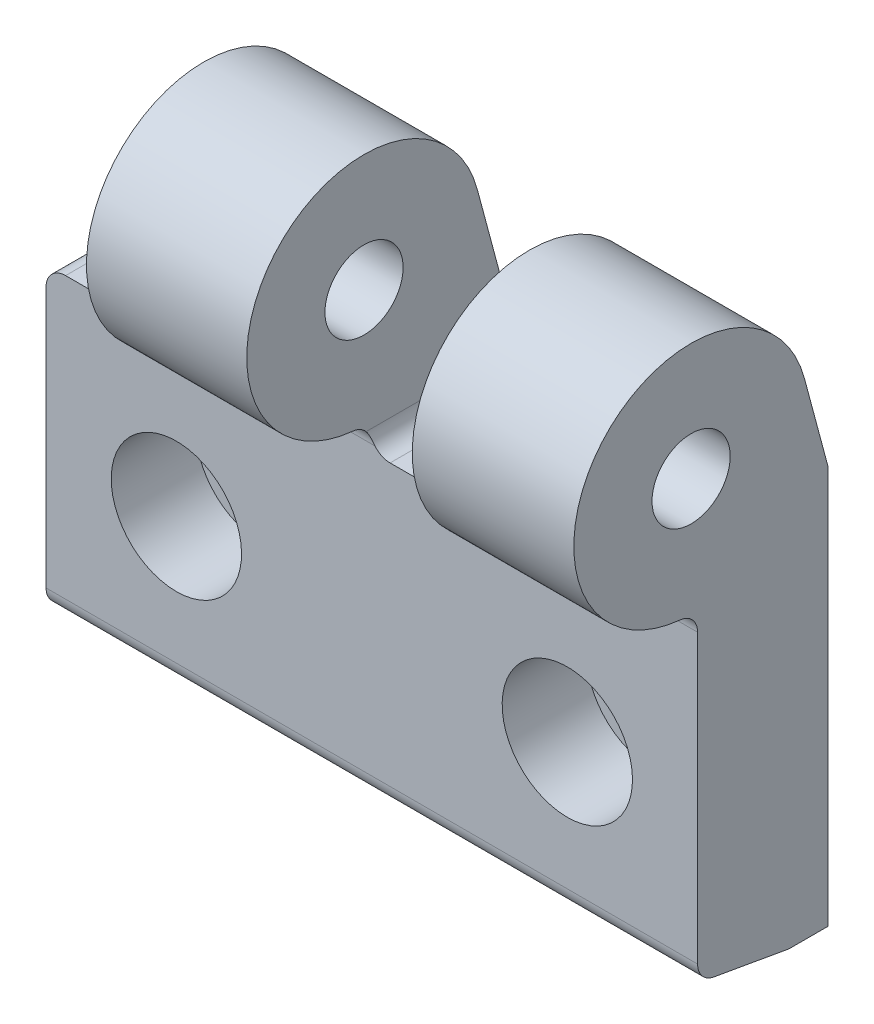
ISO-10303-21;
HEADER;
FILE_DESCRIPTION(('STEP AP214'),'2;1');
FILE_NAME('part.step','',(''),(''),'','','');
FILE_SCHEMA(('AUTOMOTIVE_DESIGN { 1 0 10303 214 1 1 1 1 }'));
ENDSEC;
DATA;
#1=APPLICATION_CONTEXT('core data for automotive mechanical design processes');
#2=APPLICATION_PROTOCOL_DEFINITION('international standard','automotive_design',2000,#1);
#3=PRODUCT_CONTEXT('',#1,'mechanical');
#4=PRODUCT('Part','Part','',(#3));
#5=PRODUCT_RELATED_PRODUCT_CATEGORY('part','',(#4));
#6=PRODUCT_DEFINITION_FORMATION('','',#4);
#7=PRODUCT_DEFINITION_CONTEXT('part definition',#1,'design');
#8=PRODUCT_DEFINITION('design','',#6,#7);
#9=PRODUCT_DEFINITION_SHAPE('','',#8);
#10=(LENGTH_UNIT() NAMED_UNIT(*) SI_UNIT(.MILLI.,.METRE.));
#11=(NAMED_UNIT(*) PLANE_ANGLE_UNIT() SI_UNIT($,.RADIAN.));
#12=(NAMED_UNIT(*) SI_UNIT($,.STERADIAN.) SOLID_ANGLE_UNIT());
#13=UNCERTAINTY_MEASURE_WITH_UNIT(LENGTH_MEASURE(1.E-05),#10,'distance_accuracy_value','');
#14=(GEOMETRIC_REPRESENTATION_CONTEXT(3) GLOBAL_UNCERTAINTY_ASSIGNED_CONTEXT((#13)) GLOBAL_UNIT_ASSIGNED_CONTEXT((#10,
#11,#12)) REPRESENTATION_CONTEXT('',''));
#15=CARTESIAN_POINT('',(0.,0.,0.));
#16=DIRECTION('',(0.,0.,1.));
#17=DIRECTION('',(1.,0.,0.));
#18=AXIS2_PLACEMENT_3D('',#15,#16,#17);
#19=CARTESIAN_POINT('',(40.,22.750000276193,10.5000324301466));
#20=DIRECTION('',(1.,0.,0.));
#21=DIRECTION('',(0.,1.,0.));
#22=AXIS2_PLACEMENT_3D('',#19,#20,#21);
#23=PLANE('',#22);
#24=DIRECTION('',(0.,0.,-1.));
#25=VECTOR('',#24,1.);
#26=CARTESIAN_POINT('',(40.,-12.25,3.));
#27=LINE('',#26,#25);
#28=CARTESIAN_POINT('',(40.,-12.25,3.));
#29=VERTEX_POINT('',#28);
#30=CARTESIAN_POINT('',(40.,-12.25,0.));
#31=VERTEX_POINT('',#30);
#32=EDGE_CURVE('E243',#29,#31,#27,.T.);
#33=ORIENTED_EDGE('',*,*,#32,.T.);
#34=DIRECTION('',(0.,1.,0.));
#35=VECTOR('',#34,1.);
#36=CARTESIAN_POINT('',(40.,-12.25,0.));
#37=LINE('',#36,#35);
#38=CARTESIAN_POINT('',(40.,18.3364567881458,0.));
#39=VERTEX_POINT('',#38);
#40=EDGE_CURVE('E244',#31,#39,#37,.T.);
#41=ORIENTED_EDGE('',*,*,#40,.T.);
#42=DIRECTION('',(0.,0.965927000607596,0.258814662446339));
#43=VECTOR('',#42,1.);
#44=CARTESIAN_POINT('',(40.,18.3364567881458,0.));
#45=LINE('',#44,#43);
#46=CARTESIAN_POINT('',(40.,25.0793174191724,1.806711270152));
#47=VERTEX_POINT('',#46);
#48=EDGE_CURVE('E247',#39,#47,#45,.T.);
#49=ORIENTED_EDGE('',*,*,#48,.T.);
#50=CARTESIAN_POINT('',(40.,22.750000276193,10.5000324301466));
#51=DIRECTION('',(1.,0.,0.));
#52=DIRECTION('',(0.,-1.,0.));
#53=AXIS2_PLACEMENT_3D('',#50,#51,#52);
#54=CIRCLE('',#53,8.99997506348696);
#55=CARTESIAN_POINT('',(40.,13.7909299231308,11.3571260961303));
#56=VERTEX_POINT('',#55);
#57=EDGE_CURVE('E250',#47,#56,#54,.T.);
#58=ORIENTED_EDGE('',*,*,#57,.T.);
#59=CARTESIAN_POINT('',(40.,12.2978016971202,11.499942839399));
#60=DIRECTION('',(-1.,0.,0.));
#61=DIRECTION('',(0.,1.,0.));
#62=AXIS2_PLACEMENT_3D('',#59,#60,#61);
#63=CIRCLE('',#62,1.4999428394);
#64=CARTESIAN_POINT('',(40.,12.2978,10.));
#65=VERTEX_POINT('',#64);
#66=EDGE_CURVE('E253',#56,#65,#63,.T.);
#67=ORIENTED_EDGE('',*,*,#66,.T.);
#68=DIRECTION('',(0.,-1.,0.));
#69=VECTOR('',#68,1.);
#70=CARTESIAN_POINT('',(40.,12.2978,10.));
#71=LINE('',#70,#69);
#72=CARTESIAN_POINT('',(40.,-9.7568,10.));
#73=VERTEX_POINT('',#72);
#74=EDGE_CURVE('E256',#65,#73,#71,.T.);
#75=ORIENTED_EDGE('',*,*,#74,.T.);
#76=CARTESIAN_POINT('',(40.,-9.75672678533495,8.49992708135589));
#77=DIRECTION('',(1.,0.,0.));
#78=DIRECTION('',(0.,1.,0.));
#79=AXIS2_PLACEMENT_3D('',#76,#77,#78);
#80=CIRCLE('',#79,1.50007292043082);
#81=CARTESIAN_POINT('',(40.,-11.233987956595,8.7605382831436));
#82=VERTEX_POINT('',#81);
#83=EDGE_CURVE('E259',#73,#82,#80,.T.);
#84=ORIENTED_EDGE('',*,*,#83,.T.);
#85=DIRECTION('',(0.,-0.173693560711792,-0.984799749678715));
#86=VECTOR('',#85,1.);
#87=CARTESIAN_POINT('',(40.,-11.233987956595,8.7605382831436));
#88=LINE('',#87,#86);
#89=EDGE_CURVE('E262',#82,#29,#88,.T.);
#90=ORIENTED_EDGE('',*,*,#89,.T.);
#91=EDGE_LOOP('',(#33,#41,#49,#58,#67,#75,#84,#90));
#92=FACE_BOUND('',#91,.T.);
#93=CARTESIAN_POINT('',(40.,22.75,10.5));
#94=DIRECTION('',(1.,0.,0.));
#95=DIRECTION('',(0.,1.,0.));
#96=AXIS2_PLACEMENT_3D('',#93,#94,#95);
#97=CIRCLE('',#96,3.);
#98=CARTESIAN_POINT('',(40.,25.75,10.5));
#99=VERTEX_POINT('',#98);
#100=EDGE_CURVE('E319',#99,#99,#97,.T.);
#101=ORIENTED_EDGE('',*,*,#100,.F.);
#102=EDGE_LOOP('',(#101));
#103=FACE_BOUND('',#102,.T.);
#104=ADVANCED_FACE('F16',(#92,#103),#23,.T.);
#105=CARTESIAN_POINT('',(27.6,13.25,35.5));
#106=DIRECTION('',(-1.,0.,0.));
#107=DIRECTION('',(0.,-1.,0.));
#108=AXIS2_PLACEMENT_3D('',#105,#106,#107);
#109=PLANE('',#108);
#110=CARTESIAN_POINT('',(27.6,22.750000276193,10.5000324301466));
#111=DIRECTION('',(-1.,0.,0.));
#112=DIRECTION('',(0.,-1.,0.));
#113=AXIS2_PLACEMENT_3D('',#110,#111,#112);
#114=CIRCLE('',#113,8.99997506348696);
#115=CARTESIAN_POINT('',(27.6,25.0793174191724,1.806711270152));
#116=VERTEX_POINT('',#115);
#117=CARTESIAN_POINT('',(27.6,13.7909299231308,11.3571260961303));
#118=VERTEX_POINT('',#117);
#119=EDGE_CURVE('E235',#116,#118,#114,.F.);
#120=ORIENTED_EDGE('',*,*,#119,.F.);
#121=DIRECTION('',(0.,-0.965927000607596,-0.258814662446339));
#122=VECTOR('',#121,1.);
#123=CARTESIAN_POINT('',(27.6,18.3364567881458,0.));
#124=LINE('',#123,#122);
#125=CARTESIAN_POINT('',(27.6,18.3364567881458,0.));
#126=VERTEX_POINT('',#125);
#127=EDGE_CURVE('E161',#116,#126,#124,.T.);
#128=ORIENTED_EDGE('',*,*,#127,.T.);
#129=DIRECTION('',(0.,-1.,0.));
#130=VECTOR('',#129,1.);
#131=CARTESIAN_POINT('',(27.6,-12.25,0.));
#132=LINE('',#131,#130);
#133=CARTESIAN_POINT('',(27.6,13.25,0.));
#134=VERTEX_POINT('',#133);
#135=EDGE_CURVE('E155',#126,#134,#132,.T.);
#136=ORIENTED_EDGE('',*,*,#135,.T.);
#137=DIRECTION('',(0.,0.,1.));
#138=VECTOR('',#137,1.);
#139=CARTESIAN_POINT('',(27.6,13.25,-14.5));
#140=LINE('',#139,#138);
#141=CARTESIAN_POINT('',(27.6,13.25,10.341000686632));
#142=VERTEX_POINT('',#141);
#143=EDGE_CURVE('E159',#134,#142,#140,.T.);
#144=ORIENTED_EDGE('',*,*,#143,.T.);
#145=CARTESIAN_POINT('',(27.6,12.2978016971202,11.499942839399));
#146=DIRECTION('',(-1.,0.,0.));
#147=DIRECTION('',(0.,-1.,0.));
#148=AXIS2_PLACEMENT_3D('',#145,#146,#147);
#149=CIRCLE('',#148,1.4999428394);
#150=EDGE_CURVE('E296',#118,#142,#149,.T.);
#151=ORIENTED_EDGE('',*,*,#150,.F.);
#152=EDGE_LOOP('',(#120,#128,#136,#144,#151));
#153=FACE_BOUND('',#152,.T.);
#154=CARTESIAN_POINT('',(27.6,22.75,10.5));
#155=DIRECTION('',(-1.,0.,0.));
#156=DIRECTION('',(0.,-1.,0.));
#157=AXIS2_PLACEMENT_3D('',#154,#155,#156);
#158=CIRCLE('',#157,3.);
#159=CARTESIAN_POINT('',(27.6,19.75,10.5));
#160=VERTEX_POINT('',#159);
#161=EDGE_CURVE('E20',#160,#160,#158,.F.);
#162=ORIENTED_EDGE('',*,*,#161,.T.);
#163=EDGE_LOOP('',(#162));
#164=FACE_BOUND('',#163,.T.);
#165=ADVANCED_FACE('F157',(#153,#164),#109,.T.);
#166=CARTESIAN_POINT('',(-10.,22.750000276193,10.5000324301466));
#167=DIRECTION('',(1.,0.,0.));
#168=DIRECTION('',(0.,1.,0.));
#169=AXIS2_PLACEMENT_3D('',#166,#167,#168);
#170=CYLINDRICAL_SURFACE('',#169,8.99997506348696);
#171=DIRECTION('',(1.,0.,0.));
#172=VECTOR('',#171,1.);
#173=CARTESIAN_POINT('',(-10.,25.0793174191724,1.806711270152));
#174=LINE('',#173,#172);
#175=CARTESIAN_POINT('',(2.6,25.0793174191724,1.806711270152));
#176=VERTEX_POINT('',#175);
#177=CARTESIAN_POINT('',(14.9,25.0793174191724,1.806711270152));
#178=VERTEX_POINT('',#177);
#179=EDGE_CURVE('E290',#176,#178,#174,.T.);
#180=ORIENTED_EDGE('',*,*,#179,.F.);
#181=CARTESIAN_POINT('',(2.6,22.750000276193,10.5000324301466));
#182=DIRECTION('',(-1.,0.,0.));
#183=DIRECTION('',(0.,-1.,0.));
#184=AXIS2_PLACEMENT_3D('',#181,#182,#183);
#185=CIRCLE('',#184,8.99997506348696);
#186=CARTESIAN_POINT('',(2.6,13.7909299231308,11.3571260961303));
#187=VERTEX_POINT('',#186);
#188=EDGE_CURVE('E240',#176,#187,#185,.F.);
#189=ORIENTED_EDGE('',*,*,#188,.T.);
#190=DIRECTION('',(1.,0.,0.));
#191=VECTOR('',#190,1.);
#192=CARTESIAN_POINT('',(-10.,13.7909299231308,11.3571260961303));
#193=LINE('',#192,#191);
#194=CARTESIAN_POINT('',(14.9,13.7909299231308,11.3571260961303));
#195=VERTEX_POINT('',#194);
#196=EDGE_CURVE('E287',#187,#195,#193,.T.);
#197=ORIENTED_EDGE('',*,*,#196,.T.);
#198=CARTESIAN_POINT('',(14.9,22.750000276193,10.5000324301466));
#199=DIRECTION('',(1.,0.,0.));
#200=DIRECTION('',(0.,1.,0.));
#201=AXIS2_PLACEMENT_3D('',#198,#199,#200);
#202=CIRCLE('',#201,8.99997506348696);
#203=EDGE_CURVE('E238',#195,#178,#202,.F.);
#204=ORIENTED_EDGE('',*,*,#203,.T.);
#205=EDGE_LOOP('',(#180,#189,#197,#204));
#206=FACE_BOUND('',#205,.T.);
#207=ADVANCED_FACE('F399',(#206),#170,.T.);
#208=CARTESIAN_POINT('',(-10.,12.2978016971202,11.499942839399));
#209=DIRECTION('',(1.,0.,0.));
#210=DIRECTION('',(0.,1.,0.));
#211=AXIS2_PLACEMENT_3D('',#208,#209,#210);
#212=CYLINDRICAL_SURFACE('',#211,1.4999428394);
#213=CARTESIAN_POINT('',(2.25901473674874,12.2978,10.));
#214=CARTESIAN_POINT('',(2.2797627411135,12.3230526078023,10.0000001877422));
#215=CARTESIAN_POINT('',(2.29967758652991,12.3489793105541,10.0006386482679));
#216=CARTESIAN_POINT('',(2.33775095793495,12.4020375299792,10.003389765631));
#217=CARTESIAN_POINT('',(2.35590848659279,12.4291697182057,10.0055032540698));
#218=CARTESIAN_POINT('',(2.40746237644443,12.5119325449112,10.0143326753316));
#219=CARTESIAN_POINT('',(2.43807845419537,12.5690984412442,10.0235349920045));
#220=CARTESIAN_POINT('',(2.49127515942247,12.6856590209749,10.0497775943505));
#221=CARTESIAN_POINT('',(2.51381870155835,12.7450626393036,10.0668532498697));
#222=CARTESIAN_POINT('',(2.55066148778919,12.8634480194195,10.1093233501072));
#223=CARTESIAN_POINT('',(2.56496299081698,12.9224298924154,10.1347155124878));
#224=CARTESIAN_POINT('',(2.58420664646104,13.0275705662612,10.1884093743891));
#225=CARTESIAN_POINT('',(2.59034341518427,13.0741764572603,10.215438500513));
#226=CARTESIAN_POINT('',(2.59825353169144,13.1645032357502,10.2745439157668));
#227=CARTESIAN_POINT('',(2.6000251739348,13.2082229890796,10.3066221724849));
#228=CARTESIAN_POINT('',(2.6,13.25,10.341000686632));
#229=B_SPLINE_CURVE_WITH_KNOTS('',3,(#213,#214,#215,#216,#217,#218,#219,#220,#221,#222,#223,
#224,#225,#226,#227,#228),.UNSPECIFIED.,.F.,.F.,(4,2,2,2,2,2,2,4),(0.,0.0980045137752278,
0.196064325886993,0.391536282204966,0.587895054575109,0.7841999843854,0.946388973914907,
1.10864132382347),.UNSPECIFIED.);
#230=CARTESIAN_POINT('',(2.25901473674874,12.2978,10.));
#231=VERTEX_POINT('',#230);
#232=CARTESIAN_POINT('',(2.6,13.25,10.341000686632));
#233=VERTEX_POINT('',#232);
#234=EDGE_CURVE('E224',#231,#233,#229,.T.);
#235=ORIENTED_EDGE('',*,*,#234,.F.);
#236=DIRECTION('',(1.,0.,0.));
#237=VECTOR('',#236,1.);
#238=CARTESIAN_POINT('',(-10.,12.2978,10.));
#239=LINE('',#238,#237);
#240=CARTESIAN_POINT('',(15.2409852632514,12.2978,10.));
#241=VERTEX_POINT('',#240);
#242=EDGE_CURVE('E284',#231,#241,#239,.T.);
#243=ORIENTED_EDGE('',*,*,#242,.T.);
#244=CARTESIAN_POINT('',(14.9,13.25,10.341000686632));
#245=CARTESIAN_POINT('',(14.9000002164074,13.2247480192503,10.320251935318));
#246=CARTESIAN_POINT('',(14.900638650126,13.1988218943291,10.300336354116));
#247=CARTESIAN_POINT('',(14.9033896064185,13.1457647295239,10.2622615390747));
#248=CARTESIAN_POINT('',(14.9055029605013,13.1186330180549,10.2441033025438));
#249=CARTESIAN_POINT('',(14.9143318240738,13.0358714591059,10.1925473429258));
#250=CARTESIAN_POINT('',(14.9235335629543,12.9787061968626,10.1619299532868));
#251=CARTESIAN_POINT('',(14.9497746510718,12.8621464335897,10.1087308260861));
#252=CARTESIAN_POINT('',(14.9668493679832,12.8027429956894,10.0861861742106));
#253=CARTESIAN_POINT('',(15.0093173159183,12.6843575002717,10.0493414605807));
#254=CARTESIAN_POINT('',(15.0347082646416,12.6253753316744,10.0350391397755));
#255=CARTESIAN_POINT('',(15.0883997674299,12.520233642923,10.0157943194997));
#256=CARTESIAN_POINT('',(15.1154277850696,12.4736271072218,10.0096571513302));
#257=CARTESIAN_POINT('',(15.1745309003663,12.3832987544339,10.0017465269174));
#258=CARTESIAN_POINT('',(15.2066079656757,12.3395780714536,9.99997477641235));
#259=CARTESIAN_POINT('',(15.2409852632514,12.2978,10.));
#260=B_SPLINE_CURVE_WITH_KNOTS('',3,(#244,#245,#246,#247,#248,#249,#250,#251,#252,#253,#254,
#255,#256,#257,#258,#259),.UNSPECIFIED.,.F.,.F.,(4,2,2,2,2,2,2,4),(0.,0.0980044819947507,
0.19606426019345,0.391536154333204,0.587894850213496,0.784199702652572,0.946388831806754,
1.10864132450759),.UNSPECIFIED.);
#261=CARTESIAN_POINT('',(14.9,13.25,10.341000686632));
#262=VERTEX_POINT('',#261);
#263=EDGE_CURVE('E184',#262,#241,#260,.T.);
#264=ORIENTED_EDGE('',*,*,#263,.F.);
#265=CARTESIAN_POINT('',(14.9,12.2978016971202,11.499942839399));
#266=DIRECTION('',(1.,0.,0.));
#267=DIRECTION('',(0.,1.,0.));
#268=AXIS2_PLACEMENT_3D('',#265,#266,#267);
#269=CIRCLE('',#268,1.4999428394);
#270=EDGE_CURVE('E298',#262,#195,#269,.T.);
#271=ORIENTED_EDGE('',*,*,#270,.T.);
#272=ORIENTED_EDGE('',*,*,#196,.F.);
#273=CARTESIAN_POINT('',(2.6,12.2978016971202,11.499942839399));
#274=DIRECTION('',(-1.,0.,0.));
#275=DIRECTION('',(0.,-1.,0.));
#276=AXIS2_PLACEMENT_3D('',#273,#274,#275);
#277=CIRCLE('',#276,1.4999428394);
#278=EDGE_CURVE('E301',#187,#233,#277,.T.);
#279=ORIENTED_EDGE('',*,*,#278,.T.);
#280=EDGE_LOOP('',(#235,#243,#264,#271,#272,#279));
#281=FACE_BOUND('',#280,.T.);
#282=ADVANCED_FACE('F409',(#281),#212,.F.);
#283=CARTESIAN_POINT('',(-10.,18.3364567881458,0.));
#284=DIRECTION('',(0.,0.258814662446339,-0.965927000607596));
#285=DIRECTION('',(0.,0.965927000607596,0.258814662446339));
#286=AXIS2_PLACEMENT_3D('',#283,#284,#285);
#287=PLANE('',#286);
#288=DIRECTION('',(0.,-0.965927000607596,-0.258814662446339));
#289=VECTOR('',#288,1.);
#290=CARTESIAN_POINT('',(2.6,18.3364567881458,0.));
#291=LINE('',#290,#289);
#292=CARTESIAN_POINT('',(2.6,18.3364567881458,0.));
#293=VERTEX_POINT('',#292);
#294=EDGE_CURVE('E352',#176,#293,#291,.T.);
#295=ORIENTED_EDGE('',*,*,#294,.F.);
#296=ORIENTED_EDGE('',*,*,#179,.T.);
#297=DIRECTION('',(0.,0.965927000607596,0.258814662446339));
#298=VECTOR('',#297,1.);
#299=CARTESIAN_POINT('',(14.9,18.3364567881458,0.));
#300=LINE('',#299,#298);
#301=CARTESIAN_POINT('',(14.9,18.3364567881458,0.));
#302=VERTEX_POINT('',#301);
#303=EDGE_CURVE('E165',#302,#178,#300,.T.);
#304=ORIENTED_EDGE('',*,*,#303,.F.);
#305=DIRECTION('',(1.,0.,0.));
#306=VECTOR('',#305,1.);
#307=CARTESIAN_POINT('',(-10.,18.3364567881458,0.));
#308=LINE('',#307,#306);
#309=EDGE_CURVE('E293',#293,#302,#308,.T.);
#310=ORIENTED_EDGE('',*,*,#309,.F.);
#311=EDGE_LOOP('',(#295,#296,#304,#310));
#312=FACE_BOUND('',#311,.T.);
#313=ADVANCED_FACE('F396',(#312),#287,.T.);
#314=EDGE_CURVE('E288',#116,#47,#174,.T.);
#315=ORIENTED_EDGE('',*,*,#314,.F.);
#316=ORIENTED_EDGE('',*,*,#119,.T.);
#317=EDGE_CURVE('E285',#118,#56,#193,.T.);
#318=ORIENTED_EDGE('',*,*,#317,.T.);
#319=ORIENTED_EDGE('',*,*,#57,.F.);
#320=EDGE_LOOP('',(#315,#316,#318,#319));
#321=FACE_BOUND('',#320,.T.);
#322=ADVANCED_FACE('F421',(#321),#170,.T.);
#323=CARTESIAN_POINT('',(27.2590147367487,12.2978,10.));
#324=CARTESIAN_POINT('',(27.2797627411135,12.3230526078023,10.0000001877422));
#325=CARTESIAN_POINT('',(27.2996775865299,12.3489793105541,10.0006386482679));
#326=CARTESIAN_POINT('',(27.3377509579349,12.4020375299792,10.003389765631));
#327=CARTESIAN_POINT('',(27.3559084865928,12.4291697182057,10.0055032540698));
#328=CARTESIAN_POINT('',(27.4074623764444,12.5119325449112,10.0143326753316));
#329=CARTESIAN_POINT('',(27.4380784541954,12.5690984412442,10.0235349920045));
#330=CARTESIAN_POINT('',(27.4912751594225,12.6856590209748,10.0497775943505));
#331=CARTESIAN_POINT('',(27.5138187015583,12.7450626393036,10.0668532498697));
#332=CARTESIAN_POINT('',(27.5506614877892,12.8634480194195,10.1093233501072));
#333=CARTESIAN_POINT('',(27.564962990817,12.9224298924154,10.1347155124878));
#334=CARTESIAN_POINT('',(27.5842066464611,13.0275705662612,10.1884093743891));
#335=CARTESIAN_POINT('',(27.5903434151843,13.0741764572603,10.215438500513));
#336=CARTESIAN_POINT('',(27.5982535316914,13.1645032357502,10.2745439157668));
#337=CARTESIAN_POINT('',(27.6000251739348,13.2082229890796,10.3066221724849));
#338=CARTESIAN_POINT('',(27.6,13.25,10.341000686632));
#339=B_SPLINE_CURVE_WITH_KNOTS('',3,(#323,#324,#325,#326,#327,#328,#329,#330,#331,#332,#333,
#334,#335,#336,#337,#338),.UNSPECIFIED.,.F.,.F.,(4,2,2,2,2,2,2,4),(0.,0.0980045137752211,
0.196064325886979,0.391536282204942,0.587895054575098,0.784199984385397,0.946388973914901,
1.10864132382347),.UNSPECIFIED.);
#340=CARTESIAN_POINT('',(27.2590147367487,12.2978,10.));
#341=VERTEX_POINT('',#340);
#342=EDGE_CURVE('E174',#341,#142,#339,.T.);
#343=ORIENTED_EDGE('',*,*,#342,.F.);
#344=EDGE_CURVE('E282',#341,#65,#239,.T.);
#345=ORIENTED_EDGE('',*,*,#344,.T.);
#346=ORIENTED_EDGE('',*,*,#66,.F.);
#347=ORIENTED_EDGE('',*,*,#317,.F.);
#348=ORIENTED_EDGE('',*,*,#150,.T.);
#349=EDGE_LOOP('',(#343,#345,#346,#347,#348));
#350=FACE_BOUND('',#349,.T.);
#351=ADVANCED_FACE('F204',(#350),#212,.F.);
#352=CARTESIAN_POINT('',(-10.,-12.25,3.));
#353=DIRECTION('',(0.,-1.,0.));
#354=DIRECTION('',(1.,0.,0.));
#355=AXIS2_PLACEMENT_3D('',#352,#353,#354);
#356=PLANE('',#355);
#357=DIRECTION('',(1.,0.,0.));
#358=VECTOR('',#357,1.);
#359=CARTESIAN_POINT('',(-10.,-12.25,0.));
#360=LINE('',#359,#358);
#361=CARTESIAN_POINT('',(-10.,-12.25,0.));
#362=VERTEX_POINT('',#361);
#363=EDGE_CURVE('E294',#362,#31,#360,.T.);
#364=ORIENTED_EDGE('',*,*,#363,.T.);
#365=ORIENTED_EDGE('',*,*,#32,.F.);
#366=DIRECTION('',(1.,0.,0.));
#367=VECTOR('',#366,1.);
#368=CARTESIAN_POINT('',(-10.,-12.25,3.));
#369=LINE('',#368,#367);
#370=CARTESIAN_POINT('',(-10.,-12.25,3.));
#371=VERTEX_POINT('',#370);
#372=EDGE_CURVE('E33',#371,#29,#369,.T.);
#373=ORIENTED_EDGE('',*,*,#372,.F.);
#374=DIRECTION('',(0.,0.,-1.));
#375=VECTOR('',#374,1.);
#376=CARTESIAN_POINT('',(-10.,-12.25,3.));
#377=LINE('',#376,#375);
#378=EDGE_CURVE('E265',#371,#362,#377,.T.);
#379=ORIENTED_EDGE('',*,*,#378,.T.);
#380=EDGE_LOOP('',(#364,#365,#373,#379));
#381=FACE_BOUND('',#380,.T.);
#382=ADVANCED_FACE('F18',(#381),#356,.T.);
#383=CARTESIAN_POINT('',(-10.,-12.25,0.));
#384=DIRECTION('',(0.,0.,-1.));
#385=DIRECTION('',(-1.,0.,0.));
#386=AXIS2_PLACEMENT_3D('',#383,#384,#385);
#387=PLANE('',#386);
#388=CARTESIAN_POINT('',(0.,0.,0.));
#389=DIRECTION('',(0.,0.,1.));
#390=DIRECTION('',(0.,-1.,0.));
#391=AXIS2_PLACEMENT_3D('',#388,#389,#390);
#392=CIRCLE('',#391,3.25);
#393=CARTESIAN_POINT('',(0.,-3.25,0.));
#394=VERTEX_POINT('',#393);
#395=EDGE_CURVE('E961',#394,#394,#392,.T.);
#396=ORIENTED_EDGE('',*,*,#395,.T.);
#397=EDGE_LOOP('',(#396));
#398=FACE_BOUND('',#397,.T.);
#399=CARTESIAN_POINT('',(30.,0.,0.));
#400=DIRECTION('',(0.,0.,1.));
#401=DIRECTION('',(0.,-1.,0.));
#402=AXIS2_PLACEMENT_3D('',#399,#400,#401);
#403=CIRCLE('',#402,3.25);
#404=CARTESIAN_POINT('',(30.,-3.25,0.));
#405=VERTEX_POINT('',#404);
#406=EDGE_CURVE('E974',#405,#405,#403,.T.);
#407=ORIENTED_EDGE('',*,*,#406,.T.);
#408=EDGE_LOOP('',(#407));
#409=FACE_BOUND('',#408,.T.);
#410=CARTESIAN_POINT('',(-8.5010000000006,10.2500000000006,0.));
#411=DIRECTION('',(0.,0.,-1.));
#412=DIRECTION('',(-1.,0.,0.));
#413=AXIS2_PLACEMENT_3D('',#410,#411,#412);
#414=CIRCLE('',#413,1.49999999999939);
#415=CARTESIAN_POINT('',(-8.501,11.75,0.));
#416=VERTEX_POINT('',#415);
#417=CARTESIAN_POINT('',(-10.,10.304763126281,0.));
#418=VERTEX_POINT('',#417);
#419=EDGE_CURVE('E186',#416,#418,#414,.F.);
#420=ORIENTED_EDGE('',*,*,#419,.F.);
#421=DIRECTION('',(-1.,0.,0.));
#422=VECTOR('',#421,1.);
#423=CARTESIAN_POINT('',(-10.,11.75,0.));
#424=LINE('',#423,#422);
#425=CARTESIAN_POINT('',(1.1,11.75,0.));
#426=VERTEX_POINT('',#425);
#427=EDGE_CURVE('E233',#426,#416,#424,.T.);
#428=ORIENTED_EDGE('',*,*,#427,.F.);
#429=CARTESIAN_POINT('',(1.1000000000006,13.2499999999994,0.));
#430=DIRECTION('',(0.,0.,-1.));
#431=DIRECTION('',(-1.,0.,0.));
#432=AXIS2_PLACEMENT_3D('',#429,#430,#431);
#433=CIRCLE('',#432,1.49999999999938);
#434=CARTESIAN_POINT('',(2.6,13.25,0.));
#435=VERTEX_POINT('',#434);
#436=EDGE_CURVE('E231',#435,#426,#433,.T.);
#437=ORIENTED_EDGE('',*,*,#436,.F.);
#438=DIRECTION('',(0.,-1.,0.));
#439=VECTOR('',#438,1.);
#440=CARTESIAN_POINT('',(2.6,-12.25,0.));
#441=LINE('',#440,#439);
#442=EDGE_CURVE('E354',#293,#435,#441,.T.);
#443=ORIENTED_EDGE('',*,*,#442,.F.);
#444=ORIENTED_EDGE('',*,*,#309,.T.);
#445=DIRECTION('',(0.,1.,0.));
#446=VECTOR('',#445,1.);
#447=CARTESIAN_POINT('',(14.9,-12.25,0.));
#448=LINE('',#447,#446);
#449=CARTESIAN_POINT('',(14.9,13.25,0.));
#450=VERTEX_POINT('',#449);
#451=EDGE_CURVE('E350',#450,#302,#448,.T.);
#452=ORIENTED_EDGE('',*,*,#451,.F.);
#453=CARTESIAN_POINT('',(16.3999999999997,13.2499999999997,0.));
#454=DIRECTION('',(0.,0.,-1.));
#455=DIRECTION('',(-1.,0.,0.));
#456=AXIS2_PLACEMENT_3D('',#453,#454,#455);
#457=CIRCLE('',#456,1.49999999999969);
#458=CARTESIAN_POINT('',(16.4,11.75,0.));
#459=VERTEX_POINT('',#458);
#460=EDGE_CURVE('E202',#459,#450,#457,.T.);
#461=ORIENTED_EDGE('',*,*,#460,.F.);
#462=DIRECTION('',(-1.,0.,0.));
#463=VECTOR('',#462,1.);
#464=CARTESIAN_POINT('',(-10.,11.75,0.));
#465=LINE('',#464,#463);
#466=CARTESIAN_POINT('',(26.1,11.75,0.));
#467=VERTEX_POINT('',#466);
#468=EDGE_CURVE('E182',#467,#459,#465,.T.);
#469=ORIENTED_EDGE('',*,*,#468,.F.);
#470=CARTESIAN_POINT('',(26.1000000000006,13.2499999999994,0.));
#471=DIRECTION('',(0.,0.,-1.));
#472=DIRECTION('',(-1.,0.,0.));
#473=AXIS2_PLACEMENT_3D('',#470,#471,#472);
#474=CIRCLE('',#473,1.49999999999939);
#475=EDGE_CURVE('E171',#134,#467,#474,.T.);
#476=ORIENTED_EDGE('',*,*,#475,.F.);
#477=ORIENTED_EDGE('',*,*,#135,.F.);
#478=EDGE_CURVE('E291',#126,#39,#308,.T.);
#479=ORIENTED_EDGE('',*,*,#478,.T.);
#480=ORIENTED_EDGE('',*,*,#40,.F.);
#481=ORIENTED_EDGE('',*,*,#363,.F.);
#482=DIRECTION('',(0.,1.,0.));
#483=VECTOR('',#482,1.);
#484=CARTESIAN_POINT('',(-10.,-12.25,0.));
#485=LINE('',#484,#483);
#486=EDGE_CURVE('E268',#362,#418,#485,.T.);
#487=ORIENTED_EDGE('',*,*,#486,.T.);
#488=EDGE_LOOP('',(#420,#428,#437,#443,#444,#452,#461,#469,#476,#477,#479,#480,#481,#487));
#489=FACE_BOUND('',#488,.T.);
#490=ADVANCED_FACE('F180',(#398,#409,#489),#387,.T.);
#491=ORIENTED_EDGE('',*,*,#127,.F.);
#492=ORIENTED_EDGE('',*,*,#314,.T.);
#493=ORIENTED_EDGE('',*,*,#48,.F.);
#494=ORIENTED_EDGE('',*,*,#478,.F.);
#495=EDGE_LOOP('',(#491,#492,#493,#494));
#496=FACE_BOUND('',#495,.T.);
#497=ADVANCED_FACE('F425',(#496),#287,.T.);
#498=CARTESIAN_POINT('',(-10.,12.2978,10.));
#499=DIRECTION('',(0.,0.,1.));
#500=DIRECTION('',(1.,0.,0.));
#501=AXIS2_PLACEMENT_3D('',#498,#499,#500);
#502=PLANE('',#501);
#503=CARTESIAN_POINT('',(0.,0.,10.));
#504=DIRECTION('',(0.,0.,1.));
#505=DIRECTION('',(0.,-1.,0.));
#506=AXIS2_PLACEMENT_3D('',#503,#504,#505);
#507=CIRCLE('',#506,5.);
#508=CARTESIAN_POINT('',(0.,-5.,10.));
#509=VERTEX_POINT('',#508);
#510=EDGE_CURVE('E968',#509,#509,#507,.T.);
#511=ORIENTED_EDGE('',*,*,#510,.F.);
#512=EDGE_LOOP('',(#511));
#513=FACE_BOUND('',#512,.T.);
#514=CARTESIAN_POINT('',(30.,0.,10.));
#515=DIRECTION('',(0.,0.,1.));
#516=DIRECTION('',(0.,-1.,0.));
#517=AXIS2_PLACEMENT_3D('',#514,#515,#516);
#518=CIRCLE('',#517,5.);
#519=CARTESIAN_POINT('',(30.,-5.,10.));
#520=VERTEX_POINT('',#519);
#521=EDGE_CURVE('E322',#520,#520,#518,.T.);
#522=ORIENTED_EDGE('',*,*,#521,.F.);
#523=EDGE_LOOP('',(#522));
#524=FACE_BOUND('',#523,.T.);
#525=CARTESIAN_POINT('',(-8.5010000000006,10.2500000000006,10.));
#526=DIRECTION('',(0.,0.,1.));
#527=DIRECTION('',(1.,0.,0.));
#528=AXIS2_PLACEMENT_3D('',#525,#526,#527);
#529=CIRCLE('',#528,1.49999999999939);
#530=CARTESIAN_POINT('',(-10.,10.304763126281,10.));
#531=VERTEX_POINT('',#530);
#532=CARTESIAN_POINT('',(-8.501,11.75,10.));
#533=VERTEX_POINT('',#532);
#534=EDGE_CURVE('E356',#531,#533,#529,.F.);
#535=ORIENTED_EDGE('',*,*,#534,.F.);
#536=DIRECTION('',(0.,-1.,0.));
#537=VECTOR('',#536,1.);
#538=CARTESIAN_POINT('',(-10.,12.2978,10.));
#539=LINE('',#538,#537);
#540=CARTESIAN_POINT('',(-10.,-9.7568,10.));
#541=VERTEX_POINT('',#540);
#542=EDGE_CURVE('E271',#531,#541,#539,.T.);
#543=ORIENTED_EDGE('',*,*,#542,.T.);
#544=DIRECTION('',(1.,0.,0.));
#545=VECTOR('',#544,1.);
#546=CARTESIAN_POINT('',(-10.,-9.7568,10.));
#547=LINE('',#546,#545);
#548=EDGE_CURVE('E280',#541,#73,#547,.T.);
#549=ORIENTED_EDGE('',*,*,#548,.T.);
#550=ORIENTED_EDGE('',*,*,#74,.F.);
#551=ORIENTED_EDGE('',*,*,#344,.F.);
#552=CARTESIAN_POINT('',(26.1000000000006,13.2499999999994,10.));
#553=DIRECTION('',(0.,0.,1.));
#554=DIRECTION('',(1.,0.,0.));
#555=AXIS2_PLACEMENT_3D('',#552,#553,#554);
#556=CIRCLE('',#555,1.49999999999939);
#557=CARTESIAN_POINT('',(26.1,11.75,10.));
#558=VERTEX_POINT('',#557);
#559=EDGE_CURVE('E306',#558,#341,#556,.T.);
#560=ORIENTED_EDGE('',*,*,#559,.F.);
#561=DIRECTION('',(1.,0.,0.));
#562=VECTOR('',#561,1.);
#563=CARTESIAN_POINT('',(-10.,11.75,10.));
#564=LINE('',#563,#562);
#565=CARTESIAN_POINT('',(16.4,11.75,10.));
#566=VERTEX_POINT('',#565);
#567=EDGE_CURVE('E308',#566,#558,#564,.T.);
#568=ORIENTED_EDGE('',*,*,#567,.F.);
#569=CARTESIAN_POINT('',(16.3999999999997,13.2499999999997,10.));
#570=DIRECTION('',(0.,0.,1.));
#571=DIRECTION('',(1.,0.,0.));
#572=AXIS2_PLACEMENT_3D('',#569,#570,#571);
#573=CIRCLE('',#572,1.49999999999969);
#574=EDGE_CURVE('E310',#241,#566,#573,.T.);
#575=ORIENTED_EDGE('',*,*,#574,.F.);
#576=ORIENTED_EDGE('',*,*,#242,.F.);
#577=CARTESIAN_POINT('',(1.1000000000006,13.2499999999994,10.));
#578=DIRECTION('',(0.,0.,1.));
#579=DIRECTION('',(1.,0.,0.));
#580=AXIS2_PLACEMENT_3D('',#577,#578,#579);
#581=CIRCLE('',#580,1.49999999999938);
#582=CARTESIAN_POINT('',(1.1,11.75,10.));
#583=VERTEX_POINT('',#582);
#584=EDGE_CURVE('E25',#583,#231,#581,.T.);
#585=ORIENTED_EDGE('',*,*,#584,.F.);
#586=DIRECTION('',(1.,0.,0.));
#587=VECTOR('',#586,1.);
#588=CARTESIAN_POINT('',(-10.,11.75,10.));
#589=LINE('',#588,#587);
#590=EDGE_CURVE('E10',#533,#583,#589,.T.);
#591=ORIENTED_EDGE('',*,*,#590,.F.);
#592=EDGE_LOOP('',(#535,#543,#549,#550,#551,#560,#568,#575,#576,#585,#591));
#593=FACE_BOUND('',#592,.T.);
#594=ADVANCED_FACE('F378',(#513,#524,#593),#502,.T.);
#595=CARTESIAN_POINT('',(-10.,-9.75672678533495,8.49992708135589));
#596=DIRECTION('',(1.,0.,0.));
#597=DIRECTION('',(0.,1.,0.));
#598=AXIS2_PLACEMENT_3D('',#595,#596,#597);
#599=CYLINDRICAL_SURFACE('',#598,1.50007292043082);
#600=DIRECTION('',(1.,0.,0.));
#601=VECTOR('',#600,1.);
#602=CARTESIAN_POINT('',(-10.,-11.233987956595,8.7605382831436));
#603=LINE('',#602,#601);
#604=CARTESIAN_POINT('',(-10.,-11.233987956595,8.7605382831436));
#605=VERTEX_POINT('',#604);
#606=EDGE_CURVE('E40',#605,#82,#603,.T.);
#607=ORIENTED_EDGE('',*,*,#606,.T.);
#608=ORIENTED_EDGE('',*,*,#83,.F.);
#609=ORIENTED_EDGE('',*,*,#548,.F.);
#610=CARTESIAN_POINT('',(-10.,-9.75672678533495,8.49992708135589));
#611=DIRECTION('',(1.,0.,0.));
#612=DIRECTION('',(0.,1.,0.));
#613=AXIS2_PLACEMENT_3D('',#610,#611,#612);
#614=CIRCLE('',#613,1.50007292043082);
#615=EDGE_CURVE('E273',#541,#605,#614,.T.);
#616=ORIENTED_EDGE('',*,*,#615,.T.);
#617=EDGE_LOOP('',(#607,#608,#609,#616));
#618=FACE_BOUND('',#617,.T.);
#619=ADVANCED_FACE('F376',(#618),#599,.T.);
#620=CARTESIAN_POINT('',(-10.,-11.233987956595,8.7605382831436));
#621=DIRECTION('',(0.,-0.984799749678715,0.173693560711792));
#622=DIRECTION('',(0.,-0.173693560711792,-0.984799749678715));
#623=AXIS2_PLACEMENT_3D('',#620,#621,#622);
#624=PLANE('',#623);
#625=ORIENTED_EDGE('',*,*,#372,.T.);
#626=ORIENTED_EDGE('',*,*,#89,.F.);
#627=ORIENTED_EDGE('',*,*,#606,.F.);
#628=DIRECTION('',(0.,-0.173693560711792,-0.984799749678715));
#629=VECTOR('',#628,1.);
#630=CARTESIAN_POINT('',(-10.,-11.233987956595,8.7605382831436));
#631=LINE('',#630,#629);
#632=EDGE_CURVE('E275',#605,#371,#631,.T.);
#633=ORIENTED_EDGE('',*,*,#632,.T.);
#634=EDGE_LOOP('',(#625,#626,#627,#633));
#635=FACE_BOUND('',#634,.T.);
#636=ADVANCED_FACE('F369',(#635),#624,.T.);
#637=CARTESIAN_POINT('',(-10.,22.750000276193,10.5000324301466));
#638=DIRECTION('',(1.,0.,0.));
#639=DIRECTION('',(0.,1.,0.));
#640=AXIS2_PLACEMENT_3D('',#637,#638,#639);
#641=PLANE('',#640);
#642=ORIENTED_EDGE('',*,*,#542,.F.);
#643=DIRECTION('',(0.,0.,1.));
#644=VECTOR('',#643,1.);
#645=CARTESIAN_POINT('',(-10.,10.304763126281,-14.5));
#646=LINE('',#645,#644);
#647=EDGE_CURVE('E303',#531,#418,#646,.F.);
#648=ORIENTED_EDGE('',*,*,#647,.T.);
#649=ORIENTED_EDGE('',*,*,#486,.F.);
#650=ORIENTED_EDGE('',*,*,#378,.F.);
#651=ORIENTED_EDGE('',*,*,#632,.F.);
#652=ORIENTED_EDGE('',*,*,#615,.F.);
#653=EDGE_LOOP('',(#642,#648,#649,#650,#651,#652));
#654=FACE_BOUND('',#653,.T.);
#655=ADVANCED_FACE('F364',(#654),#641,.F.);
#656=CARTESIAN_POINT('',(2.6,13.25,35.5));
#657=DIRECTION('',(-1.,0.,0.));
#658=DIRECTION('',(0.,-1.,0.));
#659=AXIS2_PLACEMENT_3D('',#656,#657,#658);
#660=PLANE('',#659);
#661=CARTESIAN_POINT('',(2.6,22.75,10.5));
#662=DIRECTION('',(-1.,0.,0.));
#663=DIRECTION('',(0.,-1.,0.));
#664=AXIS2_PLACEMENT_3D('',#661,#662,#663);
#665=CIRCLE('',#664,3.);
#666=CARTESIAN_POINT('',(2.6,19.75,10.5));
#667=VERTEX_POINT('',#666);
#668=EDGE_CURVE('E176',#667,#667,#665,.T.);
#669=ORIENTED_EDGE('',*,*,#668,.F.);
#670=EDGE_LOOP('',(#669));
#671=FACE_BOUND('',#670,.T.);
#672=ORIENTED_EDGE('',*,*,#188,.F.);
#673=ORIENTED_EDGE('',*,*,#294,.T.);
#674=ORIENTED_EDGE('',*,*,#442,.T.);
#675=DIRECTION('',(0.,0.,1.));
#676=VECTOR('',#675,1.);
#677=CARTESIAN_POINT('',(2.6,13.25,-14.5));
#678=LINE('',#677,#676);
#679=EDGE_CURVE('E338',#435,#233,#678,.T.);
#680=ORIENTED_EDGE('',*,*,#679,.T.);
#681=ORIENTED_EDGE('',*,*,#278,.F.);
#682=EDGE_LOOP('',(#672,#673,#674,#680,#681));
#683=FACE_BOUND('',#682,.T.);
#684=ADVANCED_FACE('F391',(#671,#683),#660,.T.);
#685=CARTESIAN_POINT('',(14.9,31.751,35.5));
#686=DIRECTION('',(1.,0.,0.));
#687=DIRECTION('',(0.,1.,0.));
#688=AXIS2_PLACEMENT_3D('',#685,#686,#687);
#689=PLANE('',#688);
#690=CARTESIAN_POINT('',(14.9,22.75,10.5));
#691=DIRECTION('',(1.,0.,0.));
#692=DIRECTION('',(0.,1.,0.));
#693=AXIS2_PLACEMENT_3D('',#690,#691,#692);
#694=CIRCLE('',#693,3.);
#695=CARTESIAN_POINT('',(14.9,25.75,10.5));
#696=VERTEX_POINT('',#695);
#697=EDGE_CURVE('E312',#696,#696,#694,.T.);
#698=ORIENTED_EDGE('',*,*,#697,.F.);
#699=EDGE_LOOP('',(#698));
#700=FACE_BOUND('',#699,.T.);
#701=ORIENTED_EDGE('',*,*,#270,.F.);
#702=DIRECTION('',(0.,0.,1.));
#703=VECTOR('',#702,1.);
#704=CARTESIAN_POINT('',(14.9,13.25,-14.5));
#705=LINE('',#704,#703);
#706=EDGE_CURVE('E335',#450,#262,#705,.T.);
#707=ORIENTED_EDGE('',*,*,#706,.F.);
#708=ORIENTED_EDGE('',*,*,#451,.T.);
#709=ORIENTED_EDGE('',*,*,#303,.T.);
#710=ORIENTED_EDGE('',*,*,#203,.F.);
#711=EDGE_LOOP('',(#701,#707,#708,#709,#710));
#712=FACE_BOUND('',#711,.T.);
#713=ADVANCED_FACE('F403',(#700,#712),#689,.T.);
#714=CARTESIAN_POINT('',(26.1000000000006,13.2499999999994,-14.5));
#715=DIRECTION('',(0.,0.,1.));
#716=DIRECTION('',(1.,0.,0.));
#717=AXIS2_PLACEMENT_3D('',#714,#715,#716);
#718=CYLINDRICAL_SURFACE('',#717,1.49999999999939);
#719=ORIENTED_EDGE('',*,*,#475,.T.);
#720=DIRECTION('',(0.,0.,1.));
#721=VECTOR('',#720,1.);
#722=CARTESIAN_POINT('',(26.1,11.75,-14.5));
#723=LINE('',#722,#721);
#724=EDGE_CURVE('E175',#467,#558,#723,.T.);
#725=ORIENTED_EDGE('',*,*,#724,.T.);
#726=ORIENTED_EDGE('',*,*,#559,.T.);
#727=ORIENTED_EDGE('',*,*,#342,.T.);
#728=ORIENTED_EDGE('',*,*,#143,.F.);
#729=EDGE_LOOP('',(#719,#725,#726,#727,#728));
#730=FACE_BOUND('',#729,.T.);
#731=ADVANCED_FACE('F169',(#730),#718,.F.);
#732=CARTESIAN_POINT('',(16.4,11.75,-14.5));
#733=DIRECTION('',(0.,-1.,0.));
#734=DIRECTION('',(1.,0.,0.));
#735=AXIS2_PLACEMENT_3D('',#732,#733,#734);
#736=PLANE('',#735);
#737=ORIENTED_EDGE('',*,*,#468,.T.);
#738=DIRECTION('',(0.,0.,1.));
#739=VECTOR('',#738,1.);
#740=CARTESIAN_POINT('',(16.4,11.75,-14.5));
#741=LINE('',#740,#739);
#742=EDGE_CURVE('E332',#459,#566,#741,.T.);
#743=ORIENTED_EDGE('',*,*,#742,.T.);
#744=ORIENTED_EDGE('',*,*,#567,.T.);
#745=ORIENTED_EDGE('',*,*,#724,.F.);
#746=EDGE_LOOP('',(#737,#743,#744,#745));
#747=FACE_BOUND('',#746,.T.);
#748=ADVANCED_FACE('F214',(#747),#736,.F.);
#749=CARTESIAN_POINT('',(16.3999999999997,13.2499999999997,-14.5));
#750=DIRECTION('',(0.,0.,1.));
#751=DIRECTION('',(1.,0.,0.));
#752=AXIS2_PLACEMENT_3D('',#749,#750,#751);
#753=CYLINDRICAL_SURFACE('',#752,1.49999999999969);
#754=ORIENTED_EDGE('',*,*,#460,.T.);
#755=ORIENTED_EDGE('',*,*,#706,.T.);
#756=ORIENTED_EDGE('',*,*,#263,.T.);
#757=ORIENTED_EDGE('',*,*,#574,.T.);
#758=ORIENTED_EDGE('',*,*,#742,.F.);
#759=EDGE_LOOP('',(#754,#755,#756,#757,#758));
#760=FACE_BOUND('',#759,.T.);
#761=ADVANCED_FACE('F208',(#760),#753,.F.);
#762=CARTESIAN_POINT('',(-8.5010000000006,10.2500000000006,-14.5));
#763=DIRECTION('',(0.,0.,1.));
#764=DIRECTION('',(1.,0.,0.));
#765=AXIS2_PLACEMENT_3D('',#762,#763,#764);
#766=CYLINDRICAL_SURFACE('',#765,1.49999999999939);
#767=ORIENTED_EDGE('',*,*,#419,.T.);
#768=ORIENTED_EDGE('',*,*,#647,.F.);
#769=ORIENTED_EDGE('',*,*,#534,.T.);
#770=DIRECTION('',(0.,0.,1.));
#771=VECTOR('',#770,1.);
#772=CARTESIAN_POINT('',(-8.501,11.75,-14.5));
#773=LINE('',#772,#771);
#774=EDGE_CURVE('E344',#416,#533,#773,.T.);
#775=ORIENTED_EDGE('',*,*,#774,.F.);
#776=EDGE_LOOP('',(#767,#768,#769,#775));
#777=FACE_BOUND('',#776,.T.);
#778=ADVANCED_FACE('F213',(#777),#766,.T.);
#779=CARTESIAN_POINT('',(-8.501,11.75,-14.5));
#780=DIRECTION('',(0.,-1.,0.));
#781=DIRECTION('',(1.,0.,0.));
#782=AXIS2_PLACEMENT_3D('',#779,#780,#781);
#783=PLANE('',#782);
#784=ORIENTED_EDGE('',*,*,#427,.T.);
#785=ORIENTED_EDGE('',*,*,#774,.T.);
#786=ORIENTED_EDGE('',*,*,#590,.T.);
#787=DIRECTION('',(0.,0.,1.));
#788=VECTOR('',#787,1.);
#789=CARTESIAN_POINT('',(1.1,11.75,-14.5));
#790=LINE('',#789,#788);
#791=EDGE_CURVE('E341',#426,#583,#790,.T.);
#792=ORIENTED_EDGE('',*,*,#791,.F.);
#793=EDGE_LOOP('',(#784,#785,#786,#792));
#794=FACE_BOUND('',#793,.T.);
#795=ADVANCED_FACE('F221',(#794),#783,.F.);
#796=CARTESIAN_POINT('',(1.1000000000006,13.2499999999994,-14.5));
#797=DIRECTION('',(0.,0.,1.));
#798=DIRECTION('',(1.,0.,0.));
#799=AXIS2_PLACEMENT_3D('',#796,#797,#798);
#800=CYLINDRICAL_SURFACE('',#799,1.49999999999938);
#801=ORIENTED_EDGE('',*,*,#436,.T.);
#802=ORIENTED_EDGE('',*,*,#791,.T.);
#803=ORIENTED_EDGE('',*,*,#584,.T.);
#804=ORIENTED_EDGE('',*,*,#234,.T.);
#805=ORIENTED_EDGE('',*,*,#679,.F.);
#806=EDGE_LOOP('',(#801,#802,#803,#804,#805));
#807=FACE_BOUND('',#806,.T.);
#808=ADVANCED_FACE('F216',(#807),#800,.F.);
#809=CARTESIAN_POINT('',(-10.,22.75,10.5));
#810=DIRECTION('',(1.,0.,0.));
#811=DIRECTION('',(0.,1.,0.));
#812=AXIS2_PLACEMENT_3D('',#809,#810,#811);
#813=CYLINDRICAL_SURFACE('',#812,3.);
#814=ORIENTED_EDGE('',*,*,#668,.T.);
#815=EDGE_LOOP('',(#814));
#816=FACE_BOUND('',#815,.T.);
#817=ORIENTED_EDGE('',*,*,#697,.T.);
#818=EDGE_LOOP('',(#817));
#819=FACE_BOUND('',#818,.T.);
#820=ADVANCED_FACE('F220',(#816,#819),#813,.F.);
#821=CARTESIAN_POINT('',(40.,22.75,10.5));
#822=DIRECTION('',(-1.,0.,0.));
#823=DIRECTION('',(0.,-1.,0.));
#824=AXIS2_PLACEMENT_3D('',#821,#822,#823);
#825=CYLINDRICAL_SURFACE('',#824,3.);
#826=ORIENTED_EDGE('',*,*,#161,.F.);
#827=EDGE_LOOP('',(#826));
#828=FACE_BOUND('',#827,.T.);
#829=ORIENTED_EDGE('',*,*,#100,.T.);
#830=EDGE_LOOP('',(#829));
#831=FACE_BOUND('',#830,.T.);
#832=ADVANCED_FACE('F527',(#828,#831),#825,.F.);
#833=CARTESIAN_POINT('',(30.,0.,0.));
#834=DIRECTION('',(0.,0.,1.));
#835=DIRECTION('',(0.,-1.,0.));
#836=AXIS2_PLACEMENT_3D('',#833,#834,#835);
#837=CYLINDRICAL_SURFACE('',#836,5.);
#838=CARTESIAN_POINT('',(30.,0.,3.5));
#839=DIRECTION('',(0.,0.,1.));
#840=DIRECTION('',(0.,-1.,0.));
#841=AXIS2_PLACEMENT_3D('',#838,#839,#840);
#842=CIRCLE('',#841,5.);
#843=CARTESIAN_POINT('',(30.,-5.,3.5));
#844=VERTEX_POINT('',#843);
#845=EDGE_CURVE('E327',#844,#844,#842,.T.);
#846=ORIENTED_EDGE('',*,*,#845,.F.);
#847=EDGE_LOOP('',(#846));
#848=FACE_BOUND('',#847,.T.);
#849=ORIENTED_EDGE('',*,*,#521,.T.);
#850=EDGE_LOOP('',(#849));
#851=FACE_BOUND('',#850,.T.);
#852=ADVANCED_FACE('F536',(#848,#851),#837,.F.);
#853=CARTESIAN_POINT('',(25.,0.,3.5));
#854=DIRECTION('',(0.,0.,-1.));
#855=DIRECTION('',(0.,1.,0.));
#856=AXIS2_PLACEMENT_3D('',#853,#854,#855);
#857=PLANE('',#856);
#858=CARTESIAN_POINT('',(30.,0.,3.5));
#859=DIRECTION('',(0.,0.,1.));
#860=DIRECTION('',(0.,-1.,0.));
#861=AXIS2_PLACEMENT_3D('',#858,#859,#860);
#862=CIRCLE('',#861,3.25);
#863=CARTESIAN_POINT('',(30.,-3.25,3.5));
#864=VERTEX_POINT('',#863);
#865=EDGE_CURVE('E977',#864,#864,#862,.T.);
#866=ORIENTED_EDGE('',*,*,#865,.F.);
#867=EDGE_LOOP('',(#866));
#868=FACE_BOUND('',#867,.T.);
#869=ORIENTED_EDGE('',*,*,#845,.T.);
#870=EDGE_LOOP('',(#869));
#871=FACE_BOUND('',#870,.T.);
#872=ADVANCED_FACE('F545',(#868,#871),#857,.F.);
#873=CARTESIAN_POINT('',(30.,0.,0.));
#874=DIRECTION('',(0.,0.,1.));
#875=DIRECTION('',(0.,-1.,0.));
#876=AXIS2_PLACEMENT_3D('',#873,#874,#875);
#877=CYLINDRICAL_SURFACE('',#876,3.25);
#878=ORIENTED_EDGE('',*,*,#406,.F.);
#879=EDGE_LOOP('',(#878));
#880=FACE_BOUND('',#879,.T.);
#881=ORIENTED_EDGE('',*,*,#865,.T.);
#882=EDGE_LOOP('',(#881));
#883=FACE_BOUND('',#882,.T.);
#884=ADVANCED_FACE('F554',(#880,#883),#877,.F.);
#885=CARTESIAN_POINT('',(0.,0.,0.));
#886=DIRECTION('',(0.,0.,1.));
#887=DIRECTION('',(0.,-1.,0.));
#888=AXIS2_PLACEMENT_3D('',#885,#886,#887);
#889=CYLINDRICAL_SURFACE('',#888,5.);
#890=CARTESIAN_POINT('',(0.,0.,3.5));
#891=DIRECTION('',(0.,0.,1.));
#892=DIRECTION('',(0.,-1.,0.));
#893=AXIS2_PLACEMENT_3D('',#890,#891,#892);
#894=CIRCLE('',#893,5.);
#895=CARTESIAN_POINT('',(0.,-5.,3.5));
#896=VERTEX_POINT('',#895);
#897=EDGE_CURVE('E965',#896,#896,#894,.T.);
#898=ORIENTED_EDGE('',*,*,#897,.F.);
#899=EDGE_LOOP('',(#898));
#900=FACE_BOUND('',#899,.T.);
#901=ORIENTED_EDGE('',*,*,#510,.T.);
#902=EDGE_LOOP('',(#901));
#903=FACE_BOUND('',#902,.T.);
#904=ADVANCED_FACE('F563',(#900,#903),#889,.F.);
#905=CARTESIAN_POINT('',(-5.,0.,3.5));
#906=DIRECTION('',(0.,0.,-1.));
#907=DIRECTION('',(0.,1.,0.));
#908=AXIS2_PLACEMENT_3D('',#905,#906,#907);
#909=PLANE('',#908);
#910=CARTESIAN_POINT('',(0.,0.,3.5));
#911=DIRECTION('',(0.,0.,1.));
#912=DIRECTION('',(0.,-1.,0.));
#913=AXIS2_PLACEMENT_3D('',#910,#911,#912);
#914=CIRCLE('',#913,3.25);
#915=CARTESIAN_POINT('',(0.,-3.25,3.5));
#916=VERTEX_POINT('',#915);
#917=EDGE_CURVE('E964',#916,#916,#914,.T.);
#918=ORIENTED_EDGE('',*,*,#917,.F.);
#919=EDGE_LOOP('',(#918));
#920=FACE_BOUND('',#919,.T.);
#921=ORIENTED_EDGE('',*,*,#897,.T.);
#922=EDGE_LOOP('',(#921));
#923=FACE_BOUND('',#922,.T.);
#924=ADVANCED_FACE('F572',(#920,#923),#909,.F.);
#925=CARTESIAN_POINT('',(0.,0.,0.));
#926=DIRECTION('',(0.,0.,1.));
#927=DIRECTION('',(0.,-1.,0.));
#928=AXIS2_PLACEMENT_3D('',#925,#926,#927);
#929=CYLINDRICAL_SURFACE('',#928,3.25);
#930=ORIENTED_EDGE('',*,*,#395,.F.);
#931=EDGE_LOOP('',(#930));
#932=FACE_BOUND('',#931,.T.);
#933=ORIENTED_EDGE('',*,*,#917,.T.);
#934=EDGE_LOOP('',(#933));
#935=FACE_BOUND('',#934,.T.);
#936=ADVANCED_FACE('F581',(#932,#935),#929,.F.);
#937=CLOSED_SHELL('',(#104,#165,#207,#282,#313,#322,#351,#382,#490,#497,#594,#619,#636,#655,
#684,#713,#731,#748,#761,#778,#795,#808,#820,#832,#852,#872,#884,#904,#924,#936));
#938=MANIFOLD_SOLID_BREP('B1',#937);
#939=ADVANCED_BREP_SHAPE_REPRESENTATION('',(#18,#938),#14);
#940=SHAPE_DEFINITION_REPRESENTATION(#9,#939);
ENDSEC;
END-ISO-10303-21;
